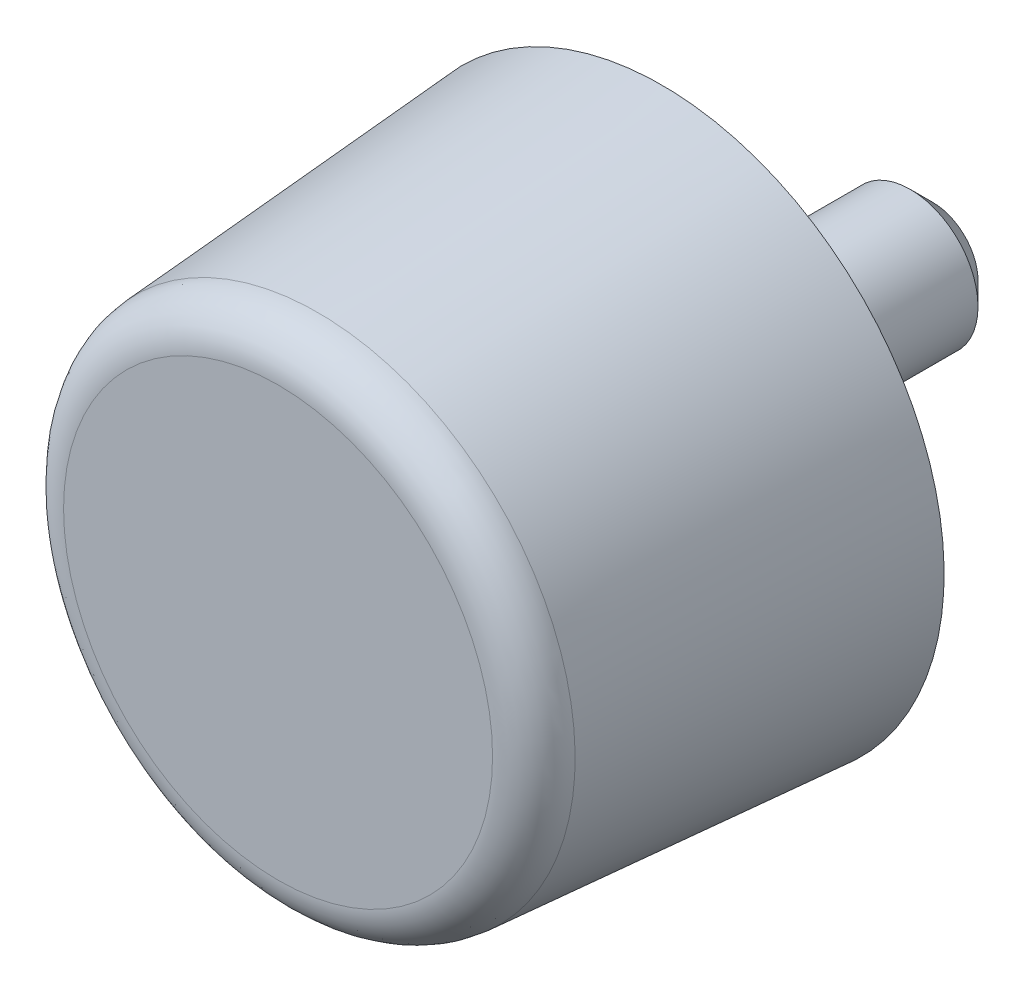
ISO-10303-21;
HEADER;
FILE_DESCRIPTION(('STEP AP214'),'2;1');
FILE_NAME('part.step','',(''),(''),'','','');
FILE_SCHEMA(('AUTOMOTIVE_DESIGN { 1 0 10303 214 1 1 1 1 }'));
ENDSEC;
DATA;
#1=APPLICATION_CONTEXT('core data for automotive mechanical design processes');
#2=APPLICATION_PROTOCOL_DEFINITION('international standard','automotive_design',2000,#1);
#3=PRODUCT_CONTEXT('',#1,'mechanical');
#4=PRODUCT('Part','Part','',(#3));
#5=PRODUCT_RELATED_PRODUCT_CATEGORY('part','',(#4));
#6=PRODUCT_DEFINITION_FORMATION('','',#4);
#7=PRODUCT_DEFINITION_CONTEXT('part definition',#1,'design');
#8=PRODUCT_DEFINITION('design','',#6,#7);
#9=PRODUCT_DEFINITION_SHAPE('','',#8);
#10=(LENGTH_UNIT() NAMED_UNIT(*) SI_UNIT(.MILLI.,.METRE.));
#11=(NAMED_UNIT(*) PLANE_ANGLE_UNIT() SI_UNIT($,.RADIAN.));
#12=(NAMED_UNIT(*) SI_UNIT($,.STERADIAN.) SOLID_ANGLE_UNIT());
#13=UNCERTAINTY_MEASURE_WITH_UNIT(LENGTH_MEASURE(1.E-05),#10,'distance_accuracy_value','');
#14=(GEOMETRIC_REPRESENTATION_CONTEXT(3) GLOBAL_UNCERTAINTY_ASSIGNED_CONTEXT((#13)) GLOBAL_UNIT_ASSIGNED_CONTEXT((#10,
#11,#12)) REPRESENTATION_CONTEXT('',''));
#15=CARTESIAN_POINT('',(0.,0.,0.));
#16=DIRECTION('',(0.,0.,1.));
#17=DIRECTION('',(1.,0.,0.));
#18=AXIS2_PLACEMENT_3D('',#15,#16,#17);
#19=CARTESIAN_POINT('',(0.,0.,17.));
#20=DIRECTION('',(0.,0.,1.));
#21=DIRECTION('',(0.,-1.,0.));
#22=AXIS2_PLACEMENT_3D('',#19,#20,#21);
#23=CYLINDRICAL_SURFACE('',#22,11.25);
#24=CARTESIAN_POINT('',(0.,0.,0.));
#25=DIRECTION('',(0.,0.,1.));
#26=DIRECTION('',(0.,-1.,0.));
#27=AXIS2_PLACEMENT_3D('',#24,#25,#26);
#28=CIRCLE('',#27,11.25);
#29=CARTESIAN_POINT('',(0.,-11.25,0.));
#30=VERTEX_POINT('',#29);
#31=EDGE_CURVE('E27',#30,#30,#28,.T.);
#32=ORIENTED_EDGE('',*,*,#31,.F.);
#33=EDGE_LOOP('',(#32));
#34=FACE_BOUND('',#33,.T.);
#35=CARTESIAN_POINT('',(0.,0.,0.0500000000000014));
#36=DIRECTION('',(0.,0.,1.));
#37=DIRECTION('',(0.,-1.,0.));
#38=AXIS2_PLACEMENT_3D('',#35,#36,#37);
#39=CIRCLE('',#38,11.25);
#40=CARTESIAN_POINT('',(0.,-11.25,0.0500000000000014));
#41=VERTEX_POINT('',#40);
#42=EDGE_CURVE('E44',#41,#41,#39,.T.);
#43=ORIENTED_EDGE('',*,*,#42,.T.);
#44=EDGE_LOOP('',(#43));
#45=FACE_BOUND('',#44,.T.);
#46=ADVANCED_FACE('F12',(#34,#45),#23,.F.);
#47=CARTESIAN_POINT('',(11.25,0.,0.));
#48=DIRECTION('',(0.,0.,1.));
#49=DIRECTION('',(0.,-1.,0.));
#50=AXIS2_PLACEMENT_3D('',#47,#48,#49);
#51=PLANE('',#50);
#52=CARTESIAN_POINT('',(0.,0.,0.));
#53=DIRECTION('',(0.,0.,1.));
#54=DIRECTION('',(0.,-1.,0.));
#55=AXIS2_PLACEMENT_3D('',#52,#53,#54);
#56=CIRCLE('',#55,12.5);
#57=CARTESIAN_POINT('',(0.,-12.5,0.));
#58=VERTEX_POINT('',#57);
#59=EDGE_CURVE('E32',#58,#58,#56,.T.);
#60=ORIENTED_EDGE('',*,*,#59,.F.);
#61=EDGE_LOOP('',(#60));
#62=FACE_BOUND('',#61,.T.);
#63=ORIENTED_EDGE('',*,*,#31,.T.);
#64=EDGE_LOOP('',(#63));
#65=FACE_BOUND('',#64,.T.);
#66=ADVANCED_FACE('F72',(#62,#65),#51,.F.);
#67=CARTESIAN_POINT('',(0.,0.,0.));
#68=DIRECTION('',(0.,0.,-1.));
#69=DIRECTION('',(0.,1.,0.));
#70=AXIS2_PLACEMENT_3D('',#67,#68,#69);
#71=CONICAL_SURFACE('',#70,12.5,0.0723905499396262);
#72=CARTESIAN_POINT('',(0.,0.,15.2374219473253));
#73=DIRECTION('',(0.,0.,1.));
#74=DIRECTION('',(0.,-1.,0.));
#75=AXIS2_PLACEMENT_3D('',#72,#73,#74);
#76=CIRCLE('',#75,11.3950238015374);
#77=CARTESIAN_POINT('',(0.,-11.3950238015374,15.2374219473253));
#78=VERTEX_POINT('',#77);
#79=EDGE_CURVE('E35',#78,#78,#76,.T.);
#80=ORIENTED_EDGE('',*,*,#79,.F.);
#81=EDGE_LOOP('',(#80));
#82=FACE_BOUND('',#81,.T.);
#83=ORIENTED_EDGE('',*,*,#59,.T.);
#84=EDGE_LOOP('',(#83));
#85=FACE_BOUND('',#84,.T.);
#86=ADVANCED_FACE('F77',(#82,#85),#71,.T.);
#87=CARTESIAN_POINT('',(0.,0.,15.1));
#88=DIRECTION('',(0.,0.,1.));
#89=DIRECTION('',(0.,-1.,0.));
#90=AXIS2_PLACEMENT_3D('',#87,#88,#89);
#91=TOROIDAL_SURFACE('',#90,9.5,1.9);
#92=ORIENTED_EDGE('',*,*,#79,.T.);
#93=EDGE_LOOP('',(#92));
#94=FACE_BOUND('',#93,.T.);
#95=CARTESIAN_POINT('',(0.,0.,17.));
#96=DIRECTION('',(0.,0.,1.));
#97=DIRECTION('',(0.,-1.,0.));
#98=AXIS2_PLACEMENT_3D('',#95,#96,#97);
#99=CIRCLE('',#98,9.5);
#100=CARTESIAN_POINT('',(0.,-9.5,17.));
#101=VERTEX_POINT('',#100);
#102=EDGE_CURVE('E38',#101,#101,#99,.T.);
#103=ORIENTED_EDGE('',*,*,#102,.F.);
#104=EDGE_LOOP('',(#103));
#105=FACE_BOUND('',#104,.T.);
#106=ADVANCED_FACE('F84',(#94,#105),#91,.T.);
#107=CARTESIAN_POINT('',(9.5,0.,17.));
#108=DIRECTION('',(0.,0.,-1.));
#109=DIRECTION('',(0.,1.,0.));
#110=AXIS2_PLACEMENT_3D('',#107,#108,#109);
#111=PLANE('',#110);
#112=ORIENTED_EDGE('',*,*,#102,.T.);
#113=EDGE_LOOP('',(#112));
#114=FACE_BOUND('',#113,.T.);
#115=ADVANCED_FACE('F59',(#114),#111,.F.);
#116=CARTESIAN_POINT('',(0.,0.,0.));
#117=DIRECTION('',(0.,0.,1.));
#118=DIRECTION('',(0.,-1.,0.));
#119=AXIS2_PLACEMENT_3D('',#116,#117,#118);
#120=PLANE('',#119);
#121=CARTESIAN_POINT('',(0.,0.,0.));
#122=DIRECTION('',(0.,0.,1.));
#123=DIRECTION('',(0.,-1.,0.));
#124=AXIS2_PLACEMENT_3D('',#121,#122,#123);
#125=CIRCLE('',#124,11.2);
#126=CARTESIAN_POINT('',(0.,-11.2,0.));
#127=VERTEX_POINT('',#126);
#128=EDGE_CURVE('E41',#127,#127,#125,.T.);
#129=ORIENTED_EDGE('',*,*,#128,.F.);
#130=EDGE_LOOP('',(#129));
#131=FACE_BOUND('',#130,.T.);
#132=CARTESIAN_POINT('',(0.,0.,0.));
#133=DIRECTION('',(0.,0.,1.));
#134=DIRECTION('',(0.,-1.,0.));
#135=AXIS2_PLACEMENT_3D('',#132,#133,#134);
#136=CIRCLE('',#135,3.);
#137=CARTESIAN_POINT('',(0.,-3.,0.));
#138=VERTEX_POINT('',#137);
#139=EDGE_CURVE('E23',#138,#138,#136,.T.);
#140=ORIENTED_EDGE('',*,*,#139,.T.);
#141=EDGE_LOOP('',(#140));
#142=FACE_BOUND('',#141,.T.);
#143=ADVANCED_FACE('F53',(#131,#142),#120,.F.);
#144=CARTESIAN_POINT('',(0.,0.,0.));
#145=DIRECTION('',(0.,0.,1.));
#146=DIRECTION('',(0.,-1.,0.));
#147=AXIS2_PLACEMENT_3D('',#144,#145,#146);
#148=CONICAL_SURFACE('',#147,11.2,0.785398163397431);
#149=ORIENTED_EDGE('',*,*,#42,.F.);
#150=EDGE_LOOP('',(#149));
#151=FACE_BOUND('',#150,.T.);
#152=ORIENTED_EDGE('',*,*,#128,.T.);
#153=EDGE_LOOP('',(#152));
#154=FACE_BOUND('',#153,.T.);
#155=ADVANCED_FACE('F49',(#151,#154),#148,.T.);
#156=CARTESIAN_POINT('',(0.,0.,17.));
#157=DIRECTION('',(0.,0.,1.));
#158=DIRECTION('',(0.,-1.,0.));
#159=AXIS2_PLACEMENT_3D('',#156,#157,#158);
#160=CYLINDRICAL_SURFACE('',#159,3.);
#161=CARTESIAN_POINT('',(0.,0.,-11.));
#162=DIRECTION('',(0.,0.,-1.));
#163=DIRECTION('',(0.,1.,0.));
#164=AXIS2_PLACEMENT_3D('',#161,#162,#163);
#165=CIRCLE('',#164,3.);
#166=CARTESIAN_POINT('',(0.,3.,-11.));
#167=VERTEX_POINT('',#166);
#168=EDGE_CURVE('E8',#167,#167,#165,.F.);
#169=ORIENTED_EDGE('',*,*,#168,.T.);
#170=EDGE_LOOP('',(#169));
#171=FACE_BOUND('',#170,.T.);
#172=ORIENTED_EDGE('',*,*,#139,.F.);
#173=EDGE_LOOP('',(#172));
#174=FACE_BOUND('',#173,.T.);
#175=ADVANCED_FACE('F52',(#171,#174),#160,.T.);
#176=CARTESIAN_POINT('',(0.,0.,-12.));
#177=DIRECTION('',(0.,0.,-1.));
#178=DIRECTION('',(0.,1.,0.));
#179=AXIS2_PLACEMENT_3D('',#176,#177,#178);
#180=PLANE('',#179);
#181=CARTESIAN_POINT('',(0.,0.,-12.));
#182=DIRECTION('',(0.,0.,-1.));
#183=DIRECTION('',(0.,1.,0.));
#184=AXIS2_PLACEMENT_3D('',#181,#182,#183);
#185=CIRCLE('',#184,2.);
#186=CARTESIAN_POINT('',(0.,2.,-12.));
#187=VERTEX_POINT('',#186);
#188=EDGE_CURVE('E19',#187,#187,#185,.T.);
#189=ORIENTED_EDGE('',*,*,#188,.T.);
#190=EDGE_LOOP('',(#189));
#191=FACE_BOUND('',#190,.T.);
#192=ADVANCED_FACE('F64',(#191),#180,.T.);
#193=CARTESIAN_POINT('',(0.,0.,-12.));
#194=DIRECTION('',(0.,0.,1.));
#195=DIRECTION('',(0.,-1.,0.));
#196=AXIS2_PLACEMENT_3D('',#193,#194,#195);
#197=CONICAL_SURFACE('',#196,2.,0.785398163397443);
#198=ORIENTED_EDGE('',*,*,#168,.F.);
#199=EDGE_LOOP('',(#198));
#200=FACE_BOUND('',#199,.T.);
#201=ORIENTED_EDGE('',*,*,#188,.F.);
#202=EDGE_LOOP('',(#201));
#203=FACE_BOUND('',#202,.T.);
#204=ADVANCED_FACE('F14',(#200,#203),#197,.T.);
#205=CLOSED_SHELL('',(#46,#66,#86,#106,#115,#143,#155,#175,#192,#204));
#206=MANIFOLD_SOLID_BREP('B1',#205);
#207=ADVANCED_BREP_SHAPE_REPRESENTATION('',(#18,#206),#14);
#208=SHAPE_DEFINITION_REPRESENTATION(#9,#207);
ENDSEC;
END-ISO-10303-21;
